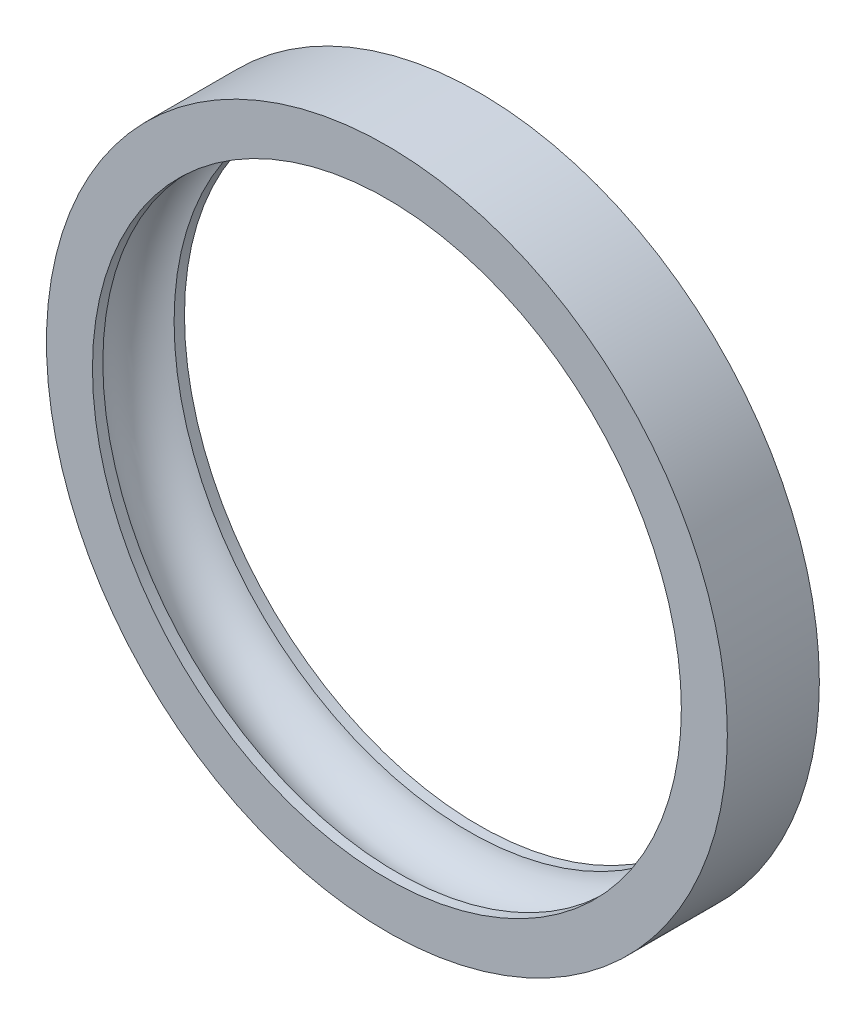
ISO-10303-21;
HEADER;
FILE_DESCRIPTION(('STEP AP214'),'2;1');
FILE_NAME('part.step','',(''),(''),'','','');
FILE_SCHEMA(('AUTOMOTIVE_DESIGN { 1 0 10303 214 1 1 1 1 }'));
ENDSEC;
DATA;
#1=APPLICATION_CONTEXT('core data for automotive mechanical design processes');
#2=APPLICATION_PROTOCOL_DEFINITION('international standard','automotive_design',2000,#1);
#3=PRODUCT_CONTEXT('',#1,'mechanical');
#4=PRODUCT('Part','Part','',(#3));
#5=PRODUCT_RELATED_PRODUCT_CATEGORY('part','',(#4));
#6=PRODUCT_DEFINITION_FORMATION('','',#4);
#7=PRODUCT_DEFINITION_CONTEXT('part definition',#1,'design');
#8=PRODUCT_DEFINITION('design','',#6,#7);
#9=PRODUCT_DEFINITION_SHAPE('','',#8);
#10=(LENGTH_UNIT() NAMED_UNIT(*) SI_UNIT(.MILLI.,.METRE.));
#11=(NAMED_UNIT(*) PLANE_ANGLE_UNIT() SI_UNIT($,.RADIAN.));
#12=(NAMED_UNIT(*) SI_UNIT($,.STERADIAN.) SOLID_ANGLE_UNIT());
#13=UNCERTAINTY_MEASURE_WITH_UNIT(LENGTH_MEASURE(1.E-05),#10,'distance_accuracy_value','');
#14=(GEOMETRIC_REPRESENTATION_CONTEXT(3) GLOBAL_UNCERTAINTY_ASSIGNED_CONTEXT((#13)) GLOBAL_UNIT_ASSIGNED_CONTEXT((#10,
#11,#12)) REPRESENTATION_CONTEXT('',''));
#15=CARTESIAN_POINT('',(0.,0.,0.));
#16=DIRECTION('',(0.,0.,1.));
#17=DIRECTION('',(1.,0.,0.));
#18=AXIS2_PLACEMENT_3D('',#15,#16,#17);
#19=CARTESIAN_POINT('',(0.,0.,10.));
#20=DIRECTION('',(0.,0.,-1.));
#21=DIRECTION('',(-1.,0.,0.));
#22=AXIS2_PLACEMENT_3D('',#19,#20,#21);
#23=CYLINDRICAL_SURFACE('',#22,32.);
#24=CARTESIAN_POINT('',(0.,0.,1.12701665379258));
#25=DIRECTION('',(0.,0.,-1.));
#26=DIRECTION('',(-1.,0.,0.));
#27=AXIS2_PLACEMENT_3D('',#24,#25,#26);
#28=CIRCLE('',#27,32.);
#29=CARTESIAN_POINT('',(-32.,0.,1.12701665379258));
#30=VERTEX_POINT('',#29);
#31=EDGE_CURVE('E54',#30,#30,#28,.T.);
#32=ORIENTED_EDGE('',*,*,#31,.F.);
#33=EDGE_LOOP('',(#32));
#34=FACE_BOUND('',#33,.T.);
#35=CARTESIAN_POINT('',(0.,0.,0.));
#36=DIRECTION('',(0.,0.,1.));
#37=DIRECTION('',(1.,0.,0.));
#38=AXIS2_PLACEMENT_3D('',#35,#36,#37);
#39=CIRCLE('',#38,32.);
#40=CARTESIAN_POINT('',(32.,0.,0.));
#41=VERTEX_POINT('',#40);
#42=EDGE_CURVE('E46',#41,#41,#39,.T.);
#43=ORIENTED_EDGE('',*,*,#42,.F.);
#44=EDGE_LOOP('',(#43));
#45=FACE_BOUND('',#44,.T.);
#46=ADVANCED_FACE('F33',(#34,#45),#23,.F.);
#47=CARTESIAN_POINT('',(0.,0.,10.));
#48=DIRECTION('',(0.,0.,-1.));
#49=DIRECTION('',(-1.,0.,0.));
#50=AXIS2_PLACEMENT_3D('',#47,#48,#49);
#51=CYLINDRICAL_SURFACE('',#50,37.);
#52=CARTESIAN_POINT('',(0.,0.,10.));
#53=DIRECTION('',(0.,0.,1.));
#54=DIRECTION('',(1.,0.,0.));
#55=AXIS2_PLACEMENT_3D('',#52,#53,#54);
#56=CIRCLE('',#55,37.);
#57=CARTESIAN_POINT('',(37.,0.,10.));
#58=VERTEX_POINT('',#57);
#59=EDGE_CURVE('E10',#58,#58,#56,.T.);
#60=ORIENTED_EDGE('',*,*,#59,.F.);
#61=EDGE_LOOP('',(#60));
#62=FACE_BOUND('',#61,.T.);
#63=CARTESIAN_POINT('',(0.,0.,0.));
#64=DIRECTION('',(0.,0.,1.));
#65=DIRECTION('',(1.,0.,0.));
#66=AXIS2_PLACEMENT_3D('',#63,#64,#65);
#67=CIRCLE('',#66,37.);
#68=CARTESIAN_POINT('',(37.,0.,0.));
#69=VERTEX_POINT('',#68);
#70=EDGE_CURVE('E37',#69,#69,#67,.T.);
#71=ORIENTED_EDGE('',*,*,#70,.T.);
#72=EDGE_LOOP('',(#71));
#73=FACE_BOUND('',#72,.T.);
#74=ADVANCED_FACE('F35',(#62,#73),#51,.T.);
#75=CARTESIAN_POINT('',(0.,0.,10.));
#76=DIRECTION('',(0.,0.,1.));
#77=DIRECTION('',(1.,0.,0.));
#78=AXIS2_PLACEMENT_3D('',#75,#76,#77);
#79=PLANE('',#78);
#80=CARTESIAN_POINT('',(0.,0.,10.));
#81=DIRECTION('',(0.,0.,1.));
#82=DIRECTION('',(1.,0.,0.));
#83=AXIS2_PLACEMENT_3D('',#80,#81,#82);
#84=CIRCLE('',#83,32.);
#85=CARTESIAN_POINT('',(32.,0.,10.));
#86=VERTEX_POINT('',#85);
#87=EDGE_CURVE('E44',#86,#86,#84,.T.);
#88=ORIENTED_EDGE('',*,*,#87,.F.);
#89=EDGE_LOOP('',(#88));
#90=FACE_BOUND('',#89,.T.);
#91=ORIENTED_EDGE('',*,*,#59,.T.);
#92=EDGE_LOOP('',(#91));
#93=FACE_BOUND('',#92,.T.);
#94=ADVANCED_FACE('F69',(#90,#93),#79,.T.);
#95=CARTESIAN_POINT('',(0.,0.,0.));
#96=DIRECTION('',(0.,0.,1.));
#97=DIRECTION('',(1.,0.,0.));
#98=AXIS2_PLACEMENT_3D('',#95,#96,#97);
#99=PLANE('',#98);
#100=ORIENTED_EDGE('',*,*,#42,.T.);
#101=EDGE_LOOP('',(#100));
#102=FACE_BOUND('',#101,.T.);
#103=ORIENTED_EDGE('',*,*,#70,.F.);
#104=EDGE_LOOP('',(#103));
#105=FACE_BOUND('',#104,.T.);
#106=ADVANCED_FACE('F66',(#102,#105),#99,.F.);
#107=CARTESIAN_POINT('',(0.,0.,8.87298334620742));
#108=DIRECTION('',(0.,0.,-1.));
#109=DIRECTION('',(-1.,0.,0.));
#110=AXIS2_PLACEMENT_3D('',#107,#108,#109);
#111=CIRCLE('',#110,32.);
#112=CARTESIAN_POINT('',(-32.,0.,8.87298334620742));
#113=VERTEX_POINT('',#112);
#114=EDGE_CURVE('E49',#113,#113,#111,.T.);
#115=ORIENTED_EDGE('',*,*,#114,.T.);
#116=EDGE_LOOP('',(#115));
#117=FACE_BOUND('',#116,.T.);
#118=ORIENTED_EDGE('',*,*,#87,.T.);
#119=EDGE_LOOP('',(#118));
#120=FACE_BOUND('',#119,.T.);
#121=ADVANCED_FACE('F63',(#117,#120),#23,.F.);
#122=CARTESIAN_POINT('',(0.,0.,5.));
#123=DIRECTION('',(0.,0.,-1.));
#124=DIRECTION('',(-1.,0.,0.));
#125=AXIS2_PLACEMENT_3D('',#122,#123,#124);
#126=TOROIDAL_SURFACE('',#125,31.,4.);
#127=ORIENTED_EDGE('',*,*,#114,.F.);
#128=EDGE_LOOP('',(#127));
#129=FACE_BOUND('',#128,.T.);
#130=ORIENTED_EDGE('',*,*,#31,.T.);
#131=EDGE_LOOP('',(#130));
#132=FACE_BOUND('',#131,.T.);
#133=ADVANCED_FACE('F58',(#129,#132),#126,.F.);
#134=CLOSED_SHELL('',(#46,#74,#94,#106,#121,#133));
#135=MANIFOLD_SOLID_BREP('B2',#134);
#136=ADVANCED_BREP_SHAPE_REPRESENTATION('',(#18,#135),#14);
#137=SHAPE_DEFINITION_REPRESENTATION(#9,#136);
ENDSEC;
END-ISO-10303-21;
